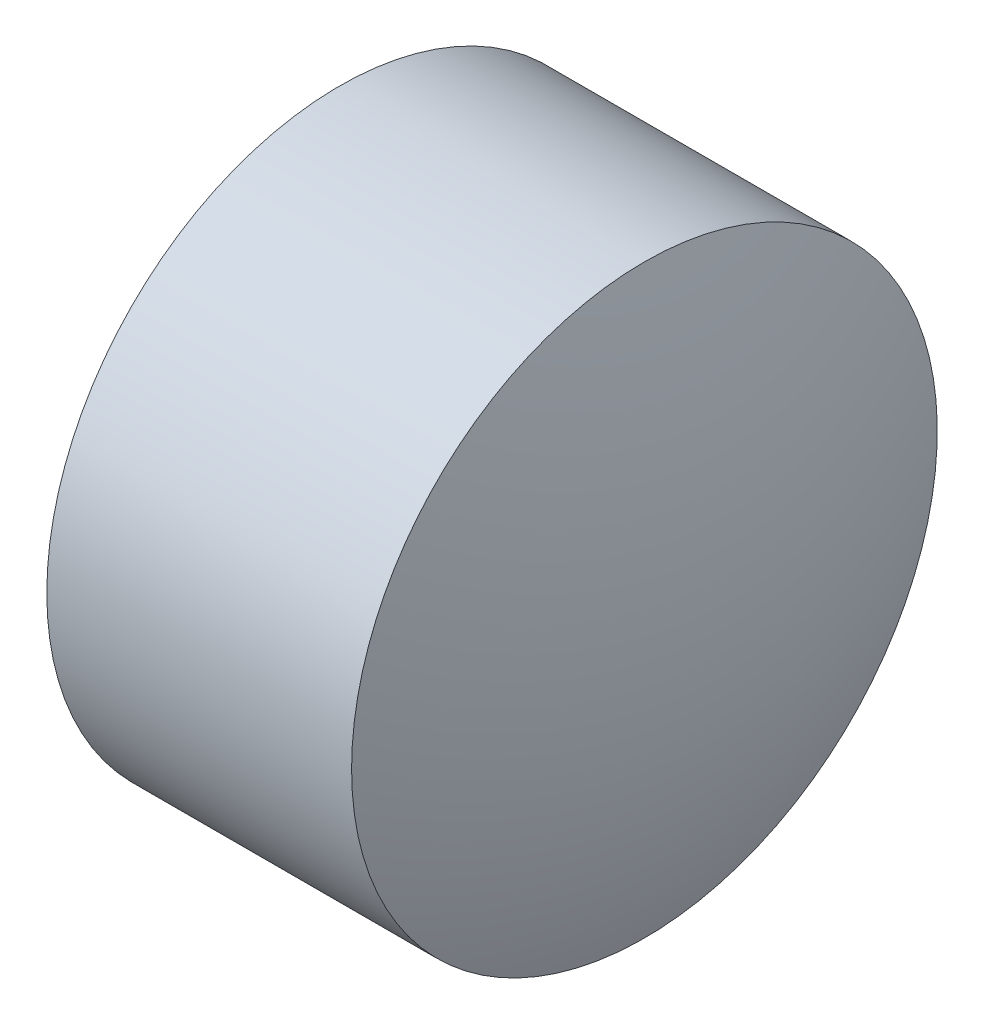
from build123d import *

# Parameters (mm, degrees)
HEXAGONSOCKET_DEPTH = 1.2


with BuildPart() as part:
    # BodySke → BaseBody (revolve)
    with BuildSketch(Plane.XY):
        with BuildLine():
            Line((0, 1.5), (0, 0))
            Line((0, 0), (2, 0))
            ThreePointArc((2, 0), (1.930171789, 0.76268014), (1.723009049, 1.5))
            Line((1.723009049, 1.5), (0, 1.5))
        make_face()
    revolve(axis=Axis((0, 0, 0), (1, 0, 0)))

    # HeadChamferSke → HeadChamfer (revolve, cut)
    with BuildSketch(Plane.XY, mode=Mode.PRIVATE) as headchamfer_sk:
        Polygon((0, 1.5), (0, 1.2195), (0.161946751, 1.5), align=None)
    revolve(headchamfer_sk.sketch.rotate(Axis((0, 0, 0), (1, 0, 0)), 90), axis=Axis((0, 0, 0), (1, 0, 0)), mode=Mode.SUBTRACT)

    # HexagonSocketSke → HexagonSocket (cut)
    with BuildSketch(Plane.ZY):
        Polygon((0, 0.866025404), (-0.75, 0.433012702), (-0.75, -0.433012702), (0, -0.866025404), (0.75, -0.433012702), (0.75, 0.433012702), align=None)
    extrude(amount=-HEXAGONSOCKET_DEPTH, mode=Mode.SUBTRACT)


solid = part.part
